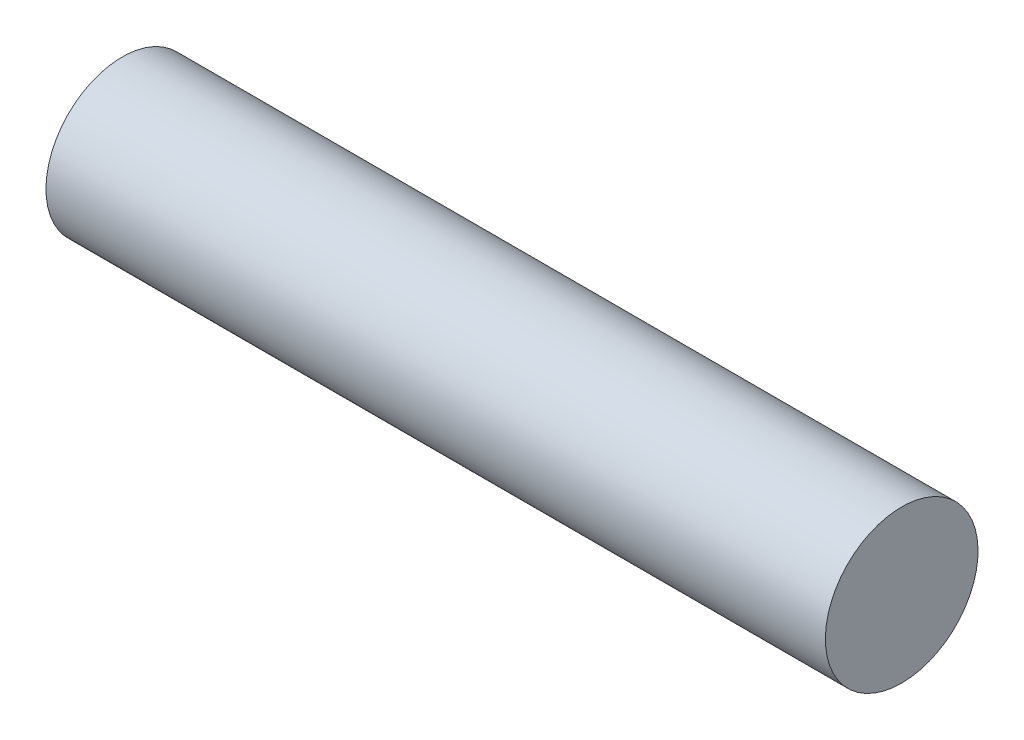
ISO-10303-21;
HEADER;
FILE_DESCRIPTION(('STEP AP214'),'2;1');
FILE_NAME('part.step','',(''),(''),'','','');
FILE_SCHEMA(('AUTOMOTIVE_DESIGN { 1 0 10303 214 1 1 1 1 }'));
ENDSEC;
DATA;
#1=APPLICATION_CONTEXT('core data for automotive mechanical design processes');
#2=APPLICATION_PROTOCOL_DEFINITION('international standard','automotive_design',2000,#1);
#3=PRODUCT_CONTEXT('',#1,'mechanical');
#4=PRODUCT('Part','Part','',(#3));
#5=PRODUCT_RELATED_PRODUCT_CATEGORY('part','',(#4));
#6=PRODUCT_DEFINITION_FORMATION('','',#4);
#7=PRODUCT_DEFINITION_CONTEXT('part definition',#1,'design');
#8=PRODUCT_DEFINITION('design','',#6,#7);
#9=PRODUCT_DEFINITION_SHAPE('','',#8);
#10=(LENGTH_UNIT() NAMED_UNIT(*) SI_UNIT(.MILLI.,.METRE.));
#11=(NAMED_UNIT(*) PLANE_ANGLE_UNIT() SI_UNIT($,.RADIAN.));
#12=(NAMED_UNIT(*) SI_UNIT($,.STERADIAN.) SOLID_ANGLE_UNIT());
#13=UNCERTAINTY_MEASURE_WITH_UNIT(LENGTH_MEASURE(1.E-05),#10,'distance_accuracy_value','');
#14=(GEOMETRIC_REPRESENTATION_CONTEXT(3) GLOBAL_UNCERTAINTY_ASSIGNED_CONTEXT((#13)) GLOBAL_UNIT_ASSIGNED_CONTEXT((#10,
#11,#12)) REPRESENTATION_CONTEXT('',''));
#15=CARTESIAN_POINT('',(0.,0.,0.));
#16=DIRECTION('',(0.,0.,1.));
#17=DIRECTION('',(1.,0.,0.));
#18=AXIS2_PLACEMENT_3D('',#15,#16,#17);
#19=CARTESIAN_POINT('',(0.,0.,0.));
#20=DIRECTION('',(1.,0.,0.));
#21=DIRECTION('',(0.,1.,0.));
#22=AXIS2_PLACEMENT_3D('',#19,#20,#21);
#23=PLANE('',#22);
#24=CARTESIAN_POINT('',(0.,0.,0.));
#25=DIRECTION('',(-1.,0.,0.));
#26=DIRECTION('',(0.,-1.,0.));
#27=AXIS2_PLACEMENT_3D('',#24,#25,#26);
#28=CIRCLE('',#27,2.9845);
#29=CARTESIAN_POINT('',(0.,-2.9845,0.));
#30=VERTEX_POINT('',#29);
#31=EDGE_CURVE('E10',#30,#30,#28,.T.);
#32=ORIENTED_EDGE('',*,*,#31,.T.);
#33=EDGE_LOOP('',(#32));
#34=FACE_BOUND('',#33,.T.);
#35=ADVANCED_FACE('F33',(#34),#23,.F.);
#36=CARTESIAN_POINT('',(30.48,0.,0.));
#37=DIRECTION('',(-1.,0.,0.));
#38=DIRECTION('',(0.,-1.,0.));
#39=AXIS2_PLACEMENT_3D('',#36,#37,#38);
#40=CYLINDRICAL_SURFACE('',#39,2.9845);
#41=ORIENTED_EDGE('',*,*,#31,.F.);
#42=EDGE_LOOP('',(#41));
#43=FACE_BOUND('',#42,.T.);
#44=CARTESIAN_POINT('',(30.48,0.,0.));
#45=DIRECTION('',(-1.,0.,0.));
#46=DIRECTION('',(0.,-1.,0.));
#47=AXIS2_PLACEMENT_3D('',#44,#45,#46);
#48=CIRCLE('',#47,2.9845);
#49=CARTESIAN_POINT('',(30.48,-2.9845,0.));
#50=VERTEX_POINT('',#49);
#51=EDGE_CURVE('E39',#50,#50,#48,.T.);
#52=ORIENTED_EDGE('',*,*,#51,.T.);
#53=EDGE_LOOP('',(#52));
#54=FACE_BOUND('',#53,.T.);
#55=ADVANCED_FACE('F45',(#43,#54),#40,.T.);
#56=CARTESIAN_POINT('',(30.48,2.9845,0.));
#57=DIRECTION('',(-1.,0.,0.));
#58=DIRECTION('',(0.,-1.,0.));
#59=AXIS2_PLACEMENT_3D('',#56,#57,#58);
#60=PLANE('',#59);
#61=ORIENTED_EDGE('',*,*,#51,.F.);
#62=EDGE_LOOP('',(#61));
#63=FACE_BOUND('',#62,.T.);
#64=ADVANCED_FACE('F47',(#63),#60,.F.);
#65=CLOSED_SHELL('',(#35,#55,#64));
#66=MANIFOLD_SOLID_BREP('B2',#65);
#67=ADVANCED_BREP_SHAPE_REPRESENTATION('',(#18,#66),#14);
#68=SHAPE_DEFINITION_REPRESENTATION(#9,#67);
ENDSEC;
END-ISO-10303-21;
